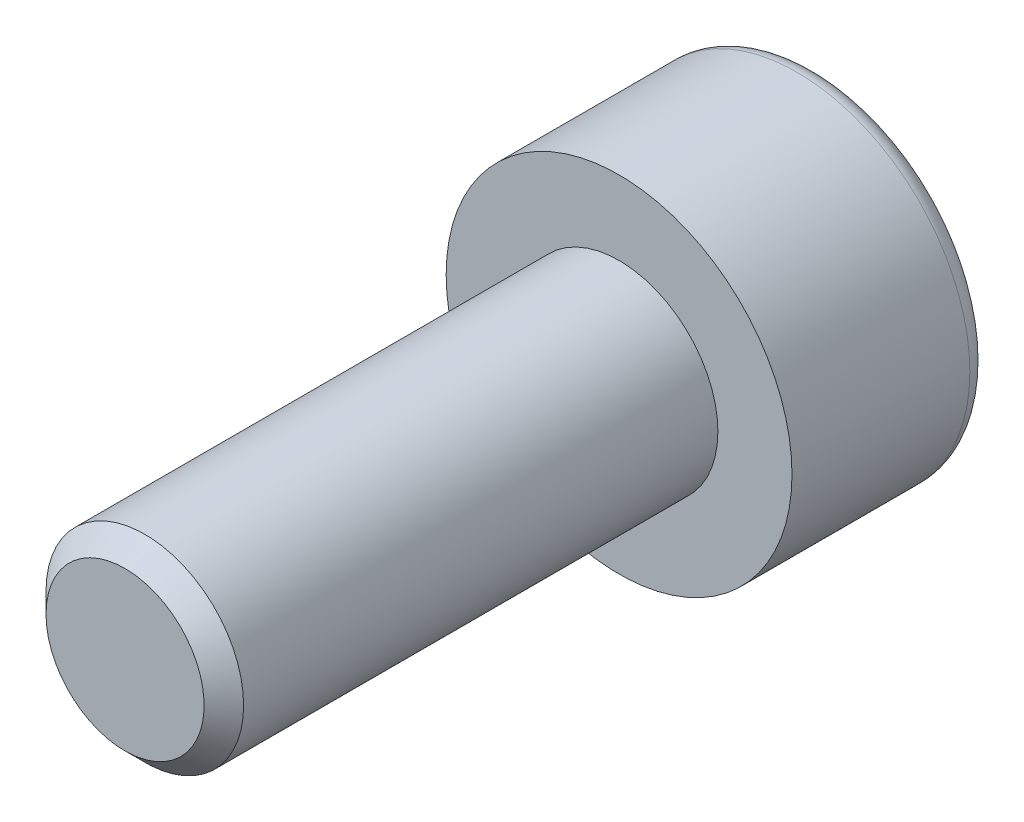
ISO-10303-21;
HEADER;
FILE_DESCRIPTION(('STEP AP214'),'2;1');
FILE_NAME('part.step','',(''),(''),'','','');
FILE_SCHEMA(('AUTOMOTIVE_DESIGN { 1 0 10303 214 1 1 1 1 }'));
ENDSEC;
DATA;
#1=APPLICATION_CONTEXT('core data for automotive mechanical design processes');
#2=APPLICATION_PROTOCOL_DEFINITION('international standard','automotive_design',2000,#1);
#3=PRODUCT_CONTEXT('',#1,'mechanical');
#4=PRODUCT('Part','Part','',(#3));
#5=PRODUCT_RELATED_PRODUCT_CATEGORY('part','',(#4));
#6=PRODUCT_DEFINITION_FORMATION('','',#4);
#7=PRODUCT_DEFINITION_CONTEXT('part definition',#1,'design');
#8=PRODUCT_DEFINITION('design','',#6,#7);
#9=PRODUCT_DEFINITION_SHAPE('','',#8);
#10=(LENGTH_UNIT() NAMED_UNIT(*) SI_UNIT(.MILLI.,.METRE.));
#11=(NAMED_UNIT(*) PLANE_ANGLE_UNIT() SI_UNIT($,.RADIAN.));
#12=(NAMED_UNIT(*) SI_UNIT($,.STERADIAN.) SOLID_ANGLE_UNIT());
#13=UNCERTAINTY_MEASURE_WITH_UNIT(LENGTH_MEASURE(1.E-05),#10,'distance_accuracy_value','');
#14=(GEOMETRIC_REPRESENTATION_CONTEXT(3) GLOBAL_UNCERTAINTY_ASSIGNED_CONTEXT((#13)) GLOBAL_UNIT_ASSIGNED_CONTEXT((#10,
#11,#12)) REPRESENTATION_CONTEXT('',''));
#15=CARTESIAN_POINT('',(0.,0.,0.));
#16=DIRECTION('',(0.,0.,1.));
#17=DIRECTION('',(1.,0.,0.));
#18=AXIS2_PLACEMENT_3D('',#15,#16,#17);
#19=CARTESIAN_POINT('',(0.,0.,-4.));
#20=DIRECTION('',(0.,0.,1.));
#21=DIRECTION('',(1.,0.,0.));
#22=AXIS2_PLACEMENT_3D('',#19,#20,#21);
#23=PLANE('',#22);
#24=CARTESIAN_POINT('',(0.,0.,-4.));
#25=DIRECTION('',(0.,0.,-1.));
#26=DIRECTION('',(-1.,0.,0.));
#27=AXIS2_PLACEMENT_3D('',#24,#25,#26);
#28=CIRCLE('',#27,3.1);
#29=CARTESIAN_POINT('',(-3.1,0.,-4.));
#30=VERTEX_POINT('',#29);
#31=EDGE_CURVE('E141',#30,#30,#28,.T.);
#32=ORIENTED_EDGE('',*,*,#31,.T.);
#33=EDGE_LOOP('',(#32));
#34=FACE_BOUND('',#33,.T.);
#35=DIRECTION('',(-0.86602540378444,0.499999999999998,0.));
#36=VECTOR('',#35,1.);
#37=CARTESIAN_POINT('',(0.,1.73205080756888,-4.));
#38=LINE('',#37,#36);
#39=CARTESIAN_POINT('',(1.5,0.866025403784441,-4.));
#40=VERTEX_POINT('',#39);
#41=CARTESIAN_POINT('',(0.,1.73205080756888,-4.));
#42=VERTEX_POINT('',#41);
#43=EDGE_CURVE('E45',#40,#42,#38,.T.);
#44=ORIENTED_EDGE('',*,*,#43,.T.);
#45=DIRECTION('',(-0.866025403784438,-0.500000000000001,0.));
#46=VECTOR('',#45,1.);
#47=CARTESIAN_POINT('',(0.,1.73205080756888,-4.));
#48=LINE('',#47,#46);
#49=CARTESIAN_POINT('',(-1.5,0.866025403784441,-4.));
#50=VERTEX_POINT('',#49);
#51=EDGE_CURVE('E85',#42,#50,#48,.T.);
#52=ORIENTED_EDGE('',*,*,#51,.T.);
#53=DIRECTION('',(0.,-1.,0.));
#54=VECTOR('',#53,1.);
#55=CARTESIAN_POINT('',(-1.5,-0.866025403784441,-4.));
#56=LINE('',#55,#54);
#57=CARTESIAN_POINT('',(-1.5,-0.866025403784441,-4.));
#58=VERTEX_POINT('',#57);
#59=EDGE_CURVE('E93',#50,#58,#56,.T.);
#60=ORIENTED_EDGE('',*,*,#59,.T.);
#61=DIRECTION('',(0.866025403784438,-0.500000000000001,0.));
#62=VECTOR('',#61,1.);
#63=CARTESIAN_POINT('',(0.,-1.73205080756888,-4.));
#64=LINE('',#63,#62);
#65=CARTESIAN_POINT('',(0.,-1.73205080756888,-4.));
#66=VERTEX_POINT('',#65);
#67=EDGE_CURVE('E111',#58,#66,#64,.T.);
#68=ORIENTED_EDGE('',*,*,#67,.T.);
#69=DIRECTION('',(0.86602540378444,0.499999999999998,0.));
#70=VECTOR('',#69,1.);
#71=CARTESIAN_POINT('',(0.,-1.73205080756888,-4.));
#72=LINE('',#71,#70);
#73=CARTESIAN_POINT('',(1.5,-0.866025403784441,-4.));
#74=VERTEX_POINT('',#73);
#75=EDGE_CURVE('E114',#66,#74,#72,.T.);
#76=ORIENTED_EDGE('',*,*,#75,.T.);
#77=DIRECTION('',(0.,1.,0.));
#78=VECTOR('',#77,1.);
#79=CARTESIAN_POINT('',(1.5,-0.866025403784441,-4.));
#80=LINE('',#79,#78);
#81=EDGE_CURVE('E104',#74,#40,#80,.T.);
#82=ORIENTED_EDGE('',*,*,#81,.T.);
#83=EDGE_LOOP('',(#44,#52,#60,#68,#76,#82));
#84=FACE_BOUND('',#83,.T.);
#85=ADVANCED_FACE('F31',(#34,#84),#23,.F.);
#86=CARTESIAN_POINT('',(0.,0.,-3.6));
#87=DIRECTION('',(0.,0.,-1.));
#88=DIRECTION('',(-1.,0.,0.));
#89=AXIS2_PLACEMENT_3D('',#86,#87,#88);
#90=TOROIDAL_SURFACE('',#89,3.1,0.4);
#91=ORIENTED_EDGE('',*,*,#31,.F.);
#92=EDGE_LOOP('',(#91));
#93=FACE_BOUND('',#92,.T.);
#94=CARTESIAN_POINT('',(0.,0.,-3.6));
#95=DIRECTION('',(0.,0.,-1.));
#96=DIRECTION('',(-1.,0.,0.));
#97=AXIS2_PLACEMENT_3D('',#94,#95,#96);
#98=CIRCLE('',#97,3.5);
#99=CARTESIAN_POINT('',(-3.5,0.,-3.6));
#100=VERTEX_POINT('',#99);
#101=EDGE_CURVE('E138',#100,#100,#98,.T.);
#102=ORIENTED_EDGE('',*,*,#101,.T.);
#103=EDGE_LOOP('',(#102));
#104=FACE_BOUND('',#103,.T.);
#105=ADVANCED_FACE('F160',(#93,#104),#90,.T.);
#106=CARTESIAN_POINT('',(0.,0.,0.));
#107=DIRECTION('',(0.,0.,-1.));
#108=DIRECTION('',(-1.,0.,0.));
#109=AXIS2_PLACEMENT_3D('',#106,#107,#108);
#110=CYLINDRICAL_SURFACE('',#109,3.5);
#111=ORIENTED_EDGE('',*,*,#101,.F.);
#112=EDGE_LOOP('',(#111));
#113=FACE_BOUND('',#112,.T.);
#114=CARTESIAN_POINT('',(0.,0.,0.));
#115=DIRECTION('',(0.,0.,-1.));
#116=DIRECTION('',(-1.,0.,0.));
#117=AXIS2_PLACEMENT_3D('',#114,#115,#116);
#118=CIRCLE('',#117,3.5);
#119=CARTESIAN_POINT('',(-3.5,0.,0.));
#120=VERTEX_POINT('',#119);
#121=EDGE_CURVE('E99',#120,#120,#118,.T.);
#122=ORIENTED_EDGE('',*,*,#121,.T.);
#123=EDGE_LOOP('',(#122));
#124=FACE_BOUND('',#123,.T.);
#125=ADVANCED_FACE('F165',(#113,#124),#110,.T.);
#126=CARTESIAN_POINT('',(0.,0.,0.));
#127=DIRECTION('',(0.,0.,-1.));
#128=DIRECTION('',(-1.,0.,0.));
#129=AXIS2_PLACEMENT_3D('',#126,#127,#128);
#130=PLANE('',#129);
#131=CARTESIAN_POINT('',(0.,0.,0.));
#132=DIRECTION('',(0.,0.,1.));
#133=DIRECTION('',(1.,0.,0.));
#134=AXIS2_PLACEMENT_3D('',#131,#132,#133);
#135=CIRCLE('',#134,2.);
#136=CARTESIAN_POINT('',(2.,0.,0.));
#137=VERTEX_POINT('',#136);
#138=EDGE_CURVE('E105',#137,#137,#135,.T.);
#139=ORIENTED_EDGE('',*,*,#138,.F.);
#140=EDGE_LOOP('',(#139));
#141=FACE_BOUND('',#140,.T.);
#142=ORIENTED_EDGE('',*,*,#121,.F.);
#143=EDGE_LOOP('',(#142));
#144=FACE_BOUND('',#143,.T.);
#145=ADVANCED_FACE('F173',(#141,#144),#130,.F.);
#146=CARTESIAN_POINT('',(0.,1.73205080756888,-2.));
#147=DIRECTION('',(-0.499999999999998,-0.86602540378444,0.));
#148=DIRECTION('',(0.86602540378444,-0.499999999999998,0.));
#149=AXIS2_PLACEMENT_3D('',#146,#147,#148);
#150=PLANE('',#149);
#151=ORIENTED_EDGE('',*,*,#43,.F.);
#152=DIRECTION('',(0.,0.,-1.));
#153=VECTOR('',#152,1.);
#154=CARTESIAN_POINT('',(1.5,0.866025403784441,-2.));
#155=LINE('',#154,#153);
#156=CARTESIAN_POINT('',(1.5,0.866025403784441,-2.));
#157=VERTEX_POINT('',#156);
#158=EDGE_CURVE('E127',#157,#40,#155,.T.);
#159=ORIENTED_EDGE('',*,*,#158,.F.);
#160=DIRECTION('',(-0.86602540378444,0.499999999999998,0.));
#161=VECTOR('',#160,1.);
#162=CARTESIAN_POINT('',(0.,1.73205080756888,-2.));
#163=LINE('',#162,#161);
#164=CARTESIAN_POINT('',(0.,1.73205080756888,-2.));
#165=VERTEX_POINT('',#164);
#166=EDGE_CURVE('E98',#157,#165,#163,.T.);
#167=ORIENTED_EDGE('',*,*,#166,.T.);
#168=DIRECTION('',(0.,0.,-1.));
#169=VECTOR('',#168,1.);
#170=CARTESIAN_POINT('',(0.,1.73205080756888,-2.));
#171=LINE('',#170,#169);
#172=EDGE_CURVE('E87',#165,#42,#171,.T.);
#173=ORIENTED_EDGE('',*,*,#172,.T.);
#174=EDGE_LOOP('',(#151,#159,#167,#173));
#175=FACE_BOUND('',#174,.T.);
#176=ADVANCED_FACE('F96',(#175),#150,.T.);
#177=CARTESIAN_POINT('',(0.,1.73205080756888,-2.));
#178=DIRECTION('',(0.500000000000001,-0.866025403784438,0.));
#179=DIRECTION('',(0.866025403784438,0.500000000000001,0.));
#180=AXIS2_PLACEMENT_3D('',#177,#178,#179);
#181=PLANE('',#180);
#182=ORIENTED_EDGE('',*,*,#51,.F.);
#183=ORIENTED_EDGE('',*,*,#172,.F.);
#184=DIRECTION('',(-0.866025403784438,-0.500000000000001,0.));
#185=VECTOR('',#184,1.);
#186=CARTESIAN_POINT('',(0.,1.73205080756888,-2.));
#187=LINE('',#186,#185);
#188=CARTESIAN_POINT('',(-1.5,0.866025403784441,-2.));
#189=VERTEX_POINT('',#188);
#190=EDGE_CURVE('E118',#165,#189,#187,.T.);
#191=ORIENTED_EDGE('',*,*,#190,.T.);
#192=DIRECTION('',(0.,0.,-1.));
#193=VECTOR('',#192,1.);
#194=CARTESIAN_POINT('',(-1.5,0.866025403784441,-2.));
#195=LINE('',#194,#193);
#196=EDGE_CURVE('E89',#189,#50,#195,.T.);
#197=ORIENTED_EDGE('',*,*,#196,.T.);
#198=EDGE_LOOP('',(#182,#183,#191,#197));
#199=FACE_BOUND('',#198,.T.);
#200=ADVANCED_FACE('F86',(#199),#181,.T.);
#201=CARTESIAN_POINT('',(-1.5,-0.866025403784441,-2.));
#202=DIRECTION('',(1.,0.,0.));
#203=DIRECTION('',(0.,0.,-1.));
#204=AXIS2_PLACEMENT_3D('',#201,#202,#203);
#205=PLANE('',#204);
#206=ORIENTED_EDGE('',*,*,#59,.F.);
#207=ORIENTED_EDGE('',*,*,#196,.F.);
#208=DIRECTION('',(0.,-1.,0.));
#209=VECTOR('',#208,1.);
#210=CARTESIAN_POINT('',(-1.5,-0.866025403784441,-2.));
#211=LINE('',#210,#209);
#212=CARTESIAN_POINT('',(-1.5,-0.866025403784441,-2.));
#213=VERTEX_POINT('',#212);
#214=EDGE_CURVE('E120',#189,#213,#211,.T.);
#215=ORIENTED_EDGE('',*,*,#214,.T.);
#216=DIRECTION('',(0.,0.,-1.));
#217=VECTOR('',#216,1.);
#218=CARTESIAN_POINT('',(-1.5,-0.866025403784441,-2.));
#219=LINE('',#218,#217);
#220=EDGE_CURVE('E133',#213,#58,#219,.T.);
#221=ORIENTED_EDGE('',*,*,#220,.T.);
#222=EDGE_LOOP('',(#206,#207,#215,#221));
#223=FACE_BOUND('',#222,.T.);
#224=ADVANCED_FACE('F188',(#223),#205,.T.);
#225=CARTESIAN_POINT('',(0.,-1.73205080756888,-2.));
#226=DIRECTION('',(0.500000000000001,0.866025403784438,0.));
#227=DIRECTION('',(-0.866025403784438,0.500000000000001,0.));
#228=AXIS2_PLACEMENT_3D('',#225,#226,#227);
#229=PLANE('',#228);
#230=ORIENTED_EDGE('',*,*,#67,.F.);
#231=ORIENTED_EDGE('',*,*,#220,.F.);
#232=DIRECTION('',(0.866025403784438,-0.500000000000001,0.));
#233=VECTOR('',#232,1.);
#234=CARTESIAN_POINT('',(0.,-1.73205080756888,-2.));
#235=LINE('',#234,#233);
#236=CARTESIAN_POINT('',(0.,-1.73205080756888,-2.));
#237=VERTEX_POINT('',#236);
#238=EDGE_CURVE('E122',#213,#237,#235,.T.);
#239=ORIENTED_EDGE('',*,*,#238,.T.);
#240=DIRECTION('',(0.,0.,-1.));
#241=VECTOR('',#240,1.);
#242=CARTESIAN_POINT('',(0.,-1.73205080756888,-2.));
#243=LINE('',#242,#241);
#244=EDGE_CURVE('E131',#237,#66,#243,.T.);
#245=ORIENTED_EDGE('',*,*,#244,.T.);
#246=EDGE_LOOP('',(#230,#231,#239,#245));
#247=FACE_BOUND('',#246,.T.);
#248=ADVANCED_FACE('F191',(#247),#229,.T.);
#249=CARTESIAN_POINT('',(0.,-1.73205080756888,-2.));
#250=DIRECTION('',(-0.499999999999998,0.86602540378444,0.));
#251=DIRECTION('',(-0.86602540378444,-0.499999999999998,0.));
#252=AXIS2_PLACEMENT_3D('',#249,#250,#251);
#253=PLANE('',#252);
#254=ORIENTED_EDGE('',*,*,#75,.F.);
#255=ORIENTED_EDGE('',*,*,#244,.F.);
#256=DIRECTION('',(0.86602540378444,0.499999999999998,0.));
#257=VECTOR('',#256,1.);
#258=CARTESIAN_POINT('',(0.,-1.73205080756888,-2.));
#259=LINE('',#258,#257);
#260=CARTESIAN_POINT('',(1.5,-0.866025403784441,-2.));
#261=VERTEX_POINT('',#260);
#262=EDGE_CURVE('E124',#237,#261,#259,.T.);
#263=ORIENTED_EDGE('',*,*,#262,.T.);
#264=DIRECTION('',(0.,0.,-1.));
#265=VECTOR('',#264,1.);
#266=CARTESIAN_POINT('',(1.5,-0.866025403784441,-2.));
#267=LINE('',#266,#265);
#268=EDGE_CURVE('E129',#261,#74,#267,.T.);
#269=ORIENTED_EDGE('',*,*,#268,.T.);
#270=EDGE_LOOP('',(#254,#255,#263,#269));
#271=FACE_BOUND('',#270,.T.);
#272=ADVANCED_FACE('F195',(#271),#253,.T.);
#273=CARTESIAN_POINT('',(1.5,-0.866025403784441,-2.));
#274=DIRECTION('',(-1.,0.,0.));
#275=DIRECTION('',(0.,0.,1.));
#276=AXIS2_PLACEMENT_3D('',#273,#274,#275);
#277=PLANE('',#276);
#278=ORIENTED_EDGE('',*,*,#81,.F.);
#279=ORIENTED_EDGE('',*,*,#268,.F.);
#280=DIRECTION('',(0.,1.,0.));
#281=VECTOR('',#280,1.);
#282=CARTESIAN_POINT('',(1.5,-0.866025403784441,-2.));
#283=LINE('',#282,#281);
#284=EDGE_CURVE('E52',#261,#157,#283,.T.);
#285=ORIENTED_EDGE('',*,*,#284,.T.);
#286=ORIENTED_EDGE('',*,*,#158,.T.);
#287=EDGE_LOOP('',(#278,#279,#285,#286));
#288=FACE_BOUND('',#287,.T.);
#289=ADVANCED_FACE('F199',(#288),#277,.T.);
#290=CARTESIAN_POINT('',(1.5,0.866025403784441,-2.));
#291=DIRECTION('',(0.,0.,1.));
#292=DIRECTION('',(1.,0.,0.));
#293=AXIS2_PLACEMENT_3D('',#290,#291,#292);
#294=PLANE('',#293);
#295=ORIENTED_EDGE('',*,*,#166,.F.);
#296=ORIENTED_EDGE('',*,*,#284,.F.);
#297=ORIENTED_EDGE('',*,*,#262,.F.);
#298=ORIENTED_EDGE('',*,*,#238,.F.);
#299=ORIENTED_EDGE('',*,*,#214,.F.);
#300=ORIENTED_EDGE('',*,*,#190,.F.);
#301=EDGE_LOOP('',(#295,#296,#297,#298,#299,#300));
#302=FACE_BOUND('',#301,.T.);
#303=ADVANCED_FACE('F203',(#302),#294,.F.);
#304=CARTESIAN_POINT('',(0.,0.,10.));
#305=DIRECTION('',(0.,0.,1.));
#306=DIRECTION('',(1.,0.,0.));
#307=AXIS2_PLACEMENT_3D('',#304,#305,#306);
#308=PLANE('',#307);
#309=CARTESIAN_POINT('',(0.,0.,10.));
#310=DIRECTION('',(0.,0.,1.));
#311=DIRECTION('',(1.,0.,0.));
#312=AXIS2_PLACEMENT_3D('',#309,#310,#311);
#313=CIRCLE('',#312,1.6);
#314=CARTESIAN_POINT('',(-1.6,0.,10.));
#315=VERTEX_POINT('',#314);
#316=EDGE_CURVE('E38',#315,#315,#313,.T.);
#317=ORIENTED_EDGE('',*,*,#316,.T.);
#318=EDGE_LOOP('',(#317));
#319=FACE_BOUND('',#318,.T.);
#320=ADVANCED_FACE('F146',(#319),#308,.T.);
#321=CARTESIAN_POINT('',(0.,0.,0.));
#322=DIRECTION('',(0.,0.,1.));
#323=DIRECTION('',(1.,0.,0.));
#324=AXIS2_PLACEMENT_3D('',#321,#322,#323);
#325=CYLINDRICAL_SURFACE('',#324,2.);
#326=CARTESIAN_POINT('',(0.,0.,9.6));
#327=DIRECTION('',(0.,0.,1.));
#328=DIRECTION('',(1.,0.,0.));
#329=AXIS2_PLACEMENT_3D('',#326,#327,#328);
#330=CIRCLE('',#329,2.);
#331=CARTESIAN_POINT('',(-2.,0.,9.6));
#332=VERTEX_POINT('',#331);
#333=EDGE_CURVE('E11',#332,#332,#330,.F.);
#334=ORIENTED_EDGE('',*,*,#333,.T.);
#335=EDGE_LOOP('',(#334));
#336=FACE_BOUND('',#335,.T.);
#337=ORIENTED_EDGE('',*,*,#138,.T.);
#338=EDGE_LOOP('',(#337));
#339=FACE_BOUND('',#338,.T.);
#340=ADVANCED_FACE('F150',(#336,#339),#325,.T.);
#341=CARTESIAN_POINT('',(0.,0.,10.));
#342=DIRECTION('',(0.,0.,-1.));
#343=DIRECTION('',(-1.,0.,0.));
#344=AXIS2_PLACEMENT_3D('',#341,#342,#343);
#345=CONICAL_SURFACE('',#344,1.6,0.785398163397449);
#346=CARTESIAN_POINT('',(-2.,0.,9.6));
#347=CARTESIAN_POINT('',(-1.99583333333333,0.,9.60416666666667));
#348=CARTESIAN_POINT('',(-1.99166666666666,0.,9.60833333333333));
#349=CARTESIAN_POINT('',(-1.98333333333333,0.,9.61666666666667));
#350=CARTESIAN_POINT('',(-1.97916666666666,0.,9.62083333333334));
#351=CARTESIAN_POINT('',(-1.97083333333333,0.,9.62916666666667));
#352=CARTESIAN_POINT('',(-1.96666666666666,0.,9.63333333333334));
#353=CARTESIAN_POINT('',(-1.95833333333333,0.,9.64166666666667));
#354=CARTESIAN_POINT('',(-1.95416666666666,0.,9.64583333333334));
#355=CARTESIAN_POINT('',(-1.94583333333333,0.,9.65416666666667));
#356=CARTESIAN_POINT('',(-1.94166666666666,0.,9.65833333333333));
#357=CARTESIAN_POINT('',(-1.93333333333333,0.,9.66666666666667));
#358=CARTESIAN_POINT('',(-1.92916666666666,0.,9.67083333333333));
#359=CARTESIAN_POINT('',(-1.92083333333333,0.,9.67916666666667));
#360=CARTESIAN_POINT('',(-1.91666666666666,0.,9.68333333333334));
#361=CARTESIAN_POINT('',(-1.90833333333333,0.,9.69166666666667));
#362=CARTESIAN_POINT('',(-1.90416666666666,0.,9.69583333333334));
#363=CARTESIAN_POINT('',(-1.89583333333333,0.,9.70416666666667));
#364=CARTESIAN_POINT('',(-1.89166666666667,0.,9.70833333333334));
#365=CARTESIAN_POINT('',(-1.88333333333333,0.,9.71666666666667));
#366=CARTESIAN_POINT('',(-1.87916666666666,0.,9.72083333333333));
#367=CARTESIAN_POINT('',(-1.87083333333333,0.,9.72916666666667));
#368=CARTESIAN_POINT('',(-1.86666666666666,0.,9.73333333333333));
#369=CARTESIAN_POINT('',(-1.85833333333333,0.,9.74166666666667));
#370=CARTESIAN_POINT('',(-1.85416666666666,0.,9.74583333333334));
#371=CARTESIAN_POINT('',(-1.84583333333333,0.,9.75416666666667));
#372=CARTESIAN_POINT('',(-1.84166666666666,0.,9.75833333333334));
#373=CARTESIAN_POINT('',(-1.83333333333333,0.,9.76666666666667));
#374=CARTESIAN_POINT('',(-1.82916666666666,0.,9.77083333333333));
#375=CARTESIAN_POINT('',(-1.82083333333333,0.,9.77916666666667));
#376=CARTESIAN_POINT('',(-1.81666666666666,0.,9.78333333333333));
#377=CARTESIAN_POINT('',(-1.80833333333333,0.,9.79166666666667));
#378=CARTESIAN_POINT('',(-1.80416666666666,0.,9.79583333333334));
#379=CARTESIAN_POINT('',(-1.79583333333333,0.,9.80416666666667));
#380=CARTESIAN_POINT('',(-1.79166666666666,0.,9.80833333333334));
#381=CARTESIAN_POINT('',(-1.78333333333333,0.,9.81666666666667));
#382=CARTESIAN_POINT('',(-1.77916666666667,0.,9.82083333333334));
#383=CARTESIAN_POINT('',(-1.77083333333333,0.,9.82916666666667));
#384=CARTESIAN_POINT('',(-1.76666666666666,0.,9.83333333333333));
#385=CARTESIAN_POINT('',(-1.75833333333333,0.,9.84166666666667));
#386=CARTESIAN_POINT('',(-1.75416666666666,0.,9.84583333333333));
#387=CARTESIAN_POINT('',(-1.74583333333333,0.,9.85416666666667));
#388=CARTESIAN_POINT('',(-1.74166666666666,0.,9.85833333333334));
#389=CARTESIAN_POINT('',(-1.73333333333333,0.,9.86666666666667));
#390=CARTESIAN_POINT('',(-1.72916666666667,0.,9.87083333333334));
#391=CARTESIAN_POINT('',(-1.72083333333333,0.,9.87916666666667));
#392=CARTESIAN_POINT('',(-1.71666666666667,0.,9.88333333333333));
#393=CARTESIAN_POINT('',(-1.70833333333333,0.,9.89166666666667));
#394=CARTESIAN_POINT('',(-1.70416666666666,0.,9.89583333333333));
#395=CARTESIAN_POINT('',(-1.69583333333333,0.,9.90416666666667));
#396=CARTESIAN_POINT('',(-1.69166666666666,0.,9.90833333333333));
#397=CARTESIAN_POINT('',(-1.68333333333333,0.,9.91666666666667));
#398=CARTESIAN_POINT('',(-1.67916666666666,0.,9.92083333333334));
#399=CARTESIAN_POINT('',(-1.67083333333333,0.,9.92916666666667));
#400=CARTESIAN_POINT('',(-1.66666666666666,0.,9.93333333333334));
#401=CARTESIAN_POINT('',(-1.65833333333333,0.,9.94166666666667));
#402=CARTESIAN_POINT('',(-1.65416666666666,0.,9.94583333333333));
#403=CARTESIAN_POINT('',(-1.64583333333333,0.,9.95416666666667));
#404=CARTESIAN_POINT('',(-1.64166666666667,0.,9.95833333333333));
#405=CARTESIAN_POINT('',(-1.63333333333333,0.,9.96666666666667));
#406=CARTESIAN_POINT('',(-1.62916666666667,0.,9.97083333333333));
#407=CARTESIAN_POINT('',(-1.62083333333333,0.,9.97916666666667));
#408=CARTESIAN_POINT('',(-1.61666666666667,0.,9.98333333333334));
#409=CARTESIAN_POINT('',(-1.60833333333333,0.,9.99166666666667));
#410=CARTESIAN_POINT('',(-1.60416666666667,0.,9.99583333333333));
#411=CARTESIAN_POINT('',(-1.6,0.,10.));
#412=B_SPLINE_CURVE_WITH_KNOTS('',3,(#346,#347,#348,#349,#350,#351,#352,#353,#354,#355,#356,
#357,#358,#359,#360,#361,#362,#363,#364,#365,#366,#367,#368,#369,#370,#371,#372,#373,#374,#375,
#376,#377,#378,#379,#380,#381,#382,#383,#384,#385,#386,#387,#388,#389,#390,#391,#392,#393,#394,
#395,#396,#397,#398,#399,#400,#401,#402,#403,#404,#405,#406,#407,#408,#409,#410,#411),
.UNSPECIFIED.,.F.,.F.,(4,2,2,2,2,2,2,2,2,2,2,2,2,2,2,2,2,2,2,2,2,2,2,2,2,2,2,2,2,2,2,2,4),(0.,
0.0176776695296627,0.0353553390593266,0.0530330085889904,0.0707106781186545,0.0883883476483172,
0.106066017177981,0.123743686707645,0.141421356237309,0.159099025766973,0.176776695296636,
0.1944543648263,0.212132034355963,0.229809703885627,0.24748737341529,0.265165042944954,
0.282842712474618,0.300520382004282,0.318198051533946,0.335875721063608,0.353553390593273,
0.371231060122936,0.3889087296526,0.406586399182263,0.424264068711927,0.441941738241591,
0.459619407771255,0.477297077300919,0.494974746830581,0.512652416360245,0.530330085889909,
0.548007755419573,0.565685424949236),.UNSPECIFIED.);
#413=EDGE_CURVE('BSEAM148',#332,#315,#412,.T.);
#414=ORIENTED_EDGE('',*,*,#333,.F.);
#415=ORIENTED_EDGE('',*,*,#316,.F.);
#416=ORIENTED_EDGE('',*,*,#413,.T.);
#417=ORIENTED_EDGE('',*,*,#413,.F.);
#418=EDGE_LOOP('',(#414,#416,#415,#417));
#419=FACE_BOUND('',#418,.T.);
#420=ADVANCED_FACE('F148',(#419),#345,.T.);
#421=CLOSED_SHELL('',(#85,#105,#125,#145,#176,#200,#224,#248,#272,#289,#303,#320,#340,#420));
#422=MANIFOLD_SOLID_BREP('B2',#421);
#423=ADVANCED_BREP_SHAPE_REPRESENTATION('',(#18,#422),#14);
#424=SHAPE_DEFINITION_REPRESENTATION(#9,#423);
ENDSEC;
END-ISO-10303-21;
